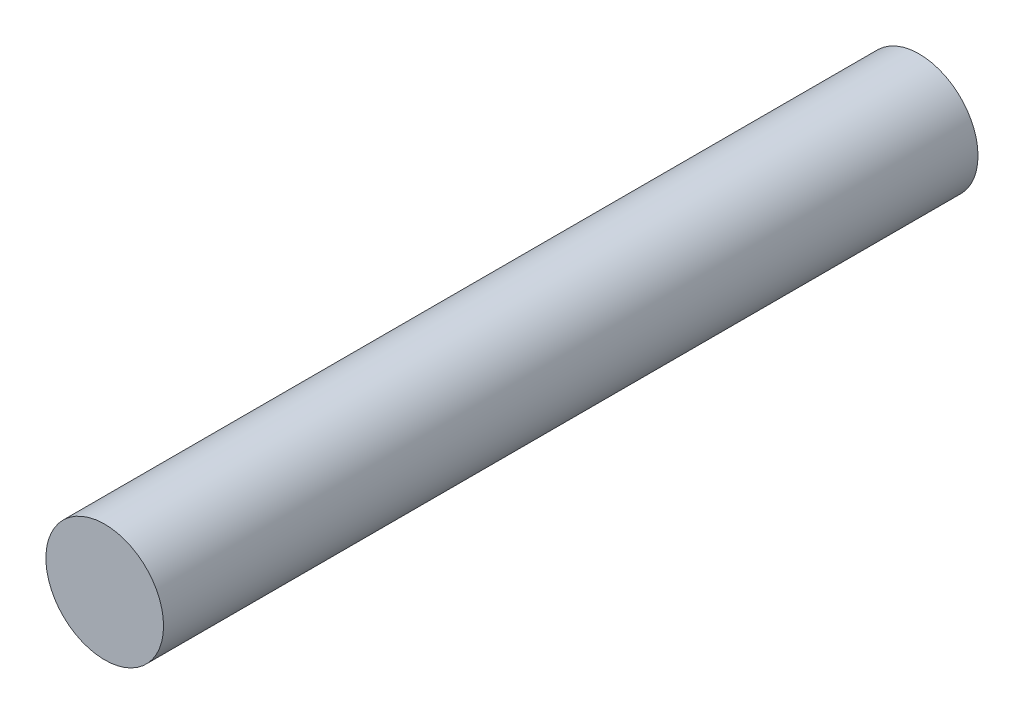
ISO-10303-21;
HEADER;
FILE_DESCRIPTION(('STEP AP214'),'2;1');
FILE_NAME('part.step','',(''),(''),'','','');
FILE_SCHEMA(('AUTOMOTIVE_DESIGN { 1 0 10303 214 1 1 1 1 }'));
ENDSEC;
DATA;
#1=APPLICATION_CONTEXT('core data for automotive mechanical design processes');
#2=APPLICATION_PROTOCOL_DEFINITION('international standard','automotive_design',2000,#1);
#3=PRODUCT_CONTEXT('',#1,'mechanical');
#4=PRODUCT('Part','Part','',(#3));
#5=PRODUCT_RELATED_PRODUCT_CATEGORY('part','',(#4));
#6=PRODUCT_DEFINITION_FORMATION('','',#4);
#7=PRODUCT_DEFINITION_CONTEXT('part definition',#1,'design');
#8=PRODUCT_DEFINITION('design','',#6,#7);
#9=PRODUCT_DEFINITION_SHAPE('','',#8);
#10=(LENGTH_UNIT() NAMED_UNIT(*) SI_UNIT(.MILLI.,.METRE.));
#11=(NAMED_UNIT(*) PLANE_ANGLE_UNIT() SI_UNIT($,.RADIAN.));
#12=(NAMED_UNIT(*) SI_UNIT($,.STERADIAN.) SOLID_ANGLE_UNIT());
#13=UNCERTAINTY_MEASURE_WITH_UNIT(LENGTH_MEASURE(1.E-05),#10,'distance_accuracy_value','');
#14=(GEOMETRIC_REPRESENTATION_CONTEXT(3) GLOBAL_UNCERTAINTY_ASSIGNED_CONTEXT((#13)) GLOBAL_UNIT_ASSIGNED_CONTEXT((#10,
#11,#12)) REPRESENTATION_CONTEXT('',''));
#15=CARTESIAN_POINT('',(0.,0.,0.));
#16=DIRECTION('',(0.,0.,1.));
#17=DIRECTION('',(1.,0.,0.));
#18=AXIS2_PLACEMENT_3D('',#15,#16,#17);
#19=CARTESIAN_POINT('',(0.,0.,45.));
#20=DIRECTION('',(0.,0.,-1.));
#21=DIRECTION('',(-1.,0.,0.));
#22=AXIS2_PLACEMENT_3D('',#19,#20,#21);
#23=CYLINDRICAL_SURFACE('',#22,3.25);
#24=CARTESIAN_POINT('',(0.,0.,45.));
#25=DIRECTION('',(0.,0.,1.));
#26=DIRECTION('',(1.,0.,0.));
#27=AXIS2_PLACEMENT_3D('',#24,#25,#26);
#28=CIRCLE('',#27,3.25);
#29=CARTESIAN_POINT('',(3.25,0.,45.));
#30=VERTEX_POINT('',#29);
#31=EDGE_CURVE('E8',#30,#30,#28,.T.);
#32=ORIENTED_EDGE('',*,*,#31,.F.);
#33=EDGE_LOOP('',(#32));
#34=FACE_BOUND('',#33,.T.);
#35=CARTESIAN_POINT('',(0.,0.,0.));
#36=DIRECTION('',(0.,0.,1.));
#37=DIRECTION('',(1.,0.,0.));
#38=AXIS2_PLACEMENT_3D('',#35,#36,#37);
#39=CIRCLE('',#38,3.25);
#40=CARTESIAN_POINT('',(3.25,0.,0.));
#41=VERTEX_POINT('',#40);
#42=EDGE_CURVE('E15',#41,#41,#39,.T.);
#43=ORIENTED_EDGE('',*,*,#42,.T.);
#44=EDGE_LOOP('',(#43));
#45=FACE_BOUND('',#44,.T.);
#46=ADVANCED_FACE('F12',(#34,#45),#23,.T.);
#47=CARTESIAN_POINT('',(0.,0.,45.));
#48=DIRECTION('',(0.,0.,1.));
#49=DIRECTION('',(1.,0.,0.));
#50=AXIS2_PLACEMENT_3D('',#47,#48,#49);
#51=PLANE('',#50);
#52=ORIENTED_EDGE('',*,*,#31,.T.);
#53=EDGE_LOOP('',(#52));
#54=FACE_BOUND('',#53,.T.);
#55=ADVANCED_FACE('F27',(#54),#51,.T.);
#56=CARTESIAN_POINT('',(0.,0.,0.));
#57=DIRECTION('',(0.,0.,1.));
#58=DIRECTION('',(1.,0.,0.));
#59=AXIS2_PLACEMENT_3D('',#56,#57,#58);
#60=PLANE('',#59);
#61=ORIENTED_EDGE('',*,*,#42,.F.);
#62=EDGE_LOOP('',(#61));
#63=FACE_BOUND('',#62,.T.);
#64=ADVANCED_FACE('F25',(#63),#60,.F.);
#65=CLOSED_SHELL('',(#46,#55,#64));
#66=MANIFOLD_SOLID_BREP('B1',#65);
#67=ADVANCED_BREP_SHAPE_REPRESENTATION('',(#18,#66),#14);
#68=SHAPE_DEFINITION_REPRESENTATION(#9,#67);
ENDSEC;
END-ISO-10303-21;
